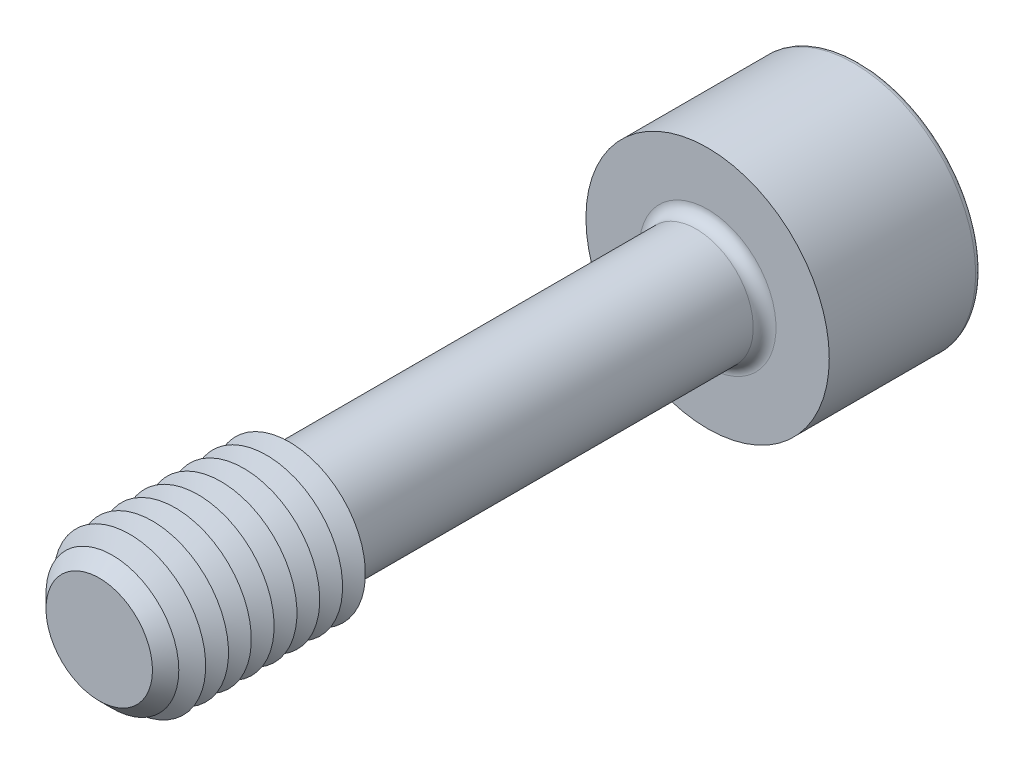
from build123d import *

# Parameters (mm, degrees)
SKETCH1_R       = 3.75
EXTRUDE1_DEPTH  = 20
CHAMFER1_SIZE   = 1.5
SKETCH3_R       = 8
EXTRUDE2_DEPTH  = 10
EXTRUDE3_DEPTH  = 8
FILLET1_R       = 0.75
FILLET2_R       = 0.375
LPATTERN1_COUNT = 8
LPATTERN1_PITCH = 1.5


with BuildPart() as part:
    # Sketch1 → Extrude1 (new, symmetric)
    with BuildSketch(Plane.XY):
        Circle(SKETCH1_R)
    extrude(amount=EXTRUDE1_DEPTH, both=True)

    # Sketch2 → Revolve1 (revolve)
    with BuildSketch(Plane(origin=(0, 0, 0), x_dir=(0, 0, -1), z_dir=(1, 0, 0))):
        Polygon((-20, 0), (-20, 5), (-7.5, 5), (-6.778312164, 3.75), (-6.778312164, 0), align=None)
    revolve(axis=Axis((0, 0, 6.778312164), (0, 0, 1)))

    # Chamfer1
    chamfer1_edges = [part.edges().sort_by_distance(p)[0] for p in [
        (0, -5, 20),
    ]]
    chamfer(chamfer1_edges, length=CHAMFER1_SIZE)

    # Sketch3 → Extrude2 (add)
    with BuildSketch(Plane(origin=(0, 0, -20), x_dir=(-1, 0, 0), z_dir=(0, 0, -1))):
        Circle(SKETCH3_R)
    extrude(amount=EXTRUDE2_DEPTH)

    # Sketch4 → Extrude3 (cut)
    with BuildSketch(Plane(origin=(-13.7, 0, -30), x_dir=(1, 0, 0), z_dir=(0, 0, 1))):
        Polygon((11.390598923, -4), (16.009401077, -4), (18.318802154, 0), (16.009401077, 4), (11.390598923, 4), (9.081197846, 0), align=None)
    extrude(amount=EXTRUDE3_DEPTH, mode=Mode.SUBTRACT)

    # Fillet1
    fillet1_edges = [part.edges().sort_by_distance(p)[0] for p in [
        (-3.75, 0, -20),
    ]]
    fillet(fillet1_edges, radius=FILLET1_R)

    # Fillet2
    fillet2_edges = [part.edges().sort_by_distance(p)[0] for p in [
        (8, 0, -30),
    ]]
    fillet(fillet2_edges, radius=FILLET2_R)

    # Sketch5 → Cut-Revolve1 (revolve, cut)
    with BuildSketch(Plane(origin=(0, 0, 0), x_dir=(0, 0, -1), z_dir=(1, 0, 0)), mode=Mode.PRIVATE) as cut_revolve1_sk:
        Polygon((22, 0), (22, -4), (19.690598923, 0), align=None)
    revolve(cut_revolve1_sk.sketch.rotate(Axis((0, 0, -19.690598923), (0, 0, -1)), 90), axis=Axis((0, 0, -19.690598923), (0, 0, -1)), mode=Mode.SUBTRACT)

    # Sketch7 → Cut-Revolve2 (revolve, cut)
    with BuildSketch(Plane(origin=(0, 0, 0), x_dir=(0, 0, -1), z_dir=(1, 0, 0)), mode=Mode.PRIVATE) as cut_revolve2_sk:
        Polygon((-7.5, 5), (-8.25, 3.700961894), (-9, 5), align=None)
    cut_revolve2 = revolve(cut_revolve2_sk.sketch.rotate(Axis((0, 0, -1.332048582), (0, 0, 1)), 90), axis=Axis((0, 0, -1.332048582), (0, 0, 1)), mode=Mode.SUBTRACT)

    # LPattern1: Cut-Revolve2 ×8
    with Locations(*[(0, 0, i * LPATTERN1_PITCH) for i in range(1, LPATTERN1_COUNT)]):
        add(cut_revolve2, mode=Mode.SUBTRACT)


solid = part.part
